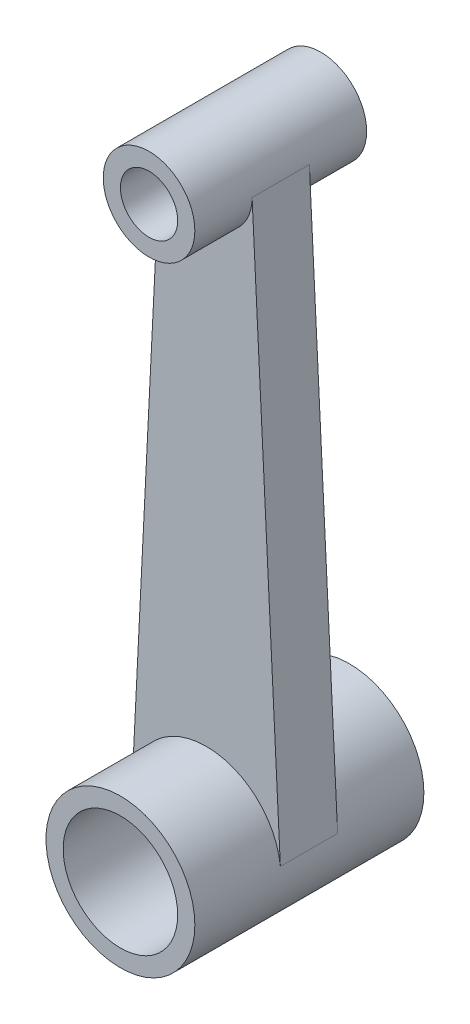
from build123d import *

# Parameters (mm, degrees)
BOSS_EXTRUDE1_DEPTH      = 19.05
BOSS_EXTRUDE1_DEPTH_BACK = 19.05
SKETCH2_R                = 10.16
SKETCH2_R_2              = 6.35
BOSS_EXTRUDE2_DEPTH      = 25.4
BOSS_EXTRUDE2_DEPTH_BACK = 25.4
SKETCH3_R                = 16.51
SKETCH3_R_2              = 12.7
BOSS_EXTRUDE3_DEPTH      = 6.35
BOSS_EXTRUDE3_DEPTH_BACK = 6.35


with BuildPart() as part:
    # Sketch2 → Boss-Extrude1 (new, two sides: drawn at the far end of the back side and taken through both)
    with BuildSketch(Plane.XY.offset(-BOSS_EXTRUDE1_DEPTH_BACK)):
        Circle(SKETCH2_R)
        Circle(SKETCH2_R_2, mode=Mode.SUBTRACT)
    extrude(amount=BOSS_EXTRUDE1_DEPTH + BOSS_EXTRUDE1_DEPTH_BACK)



with BuildPart() as body_2:
    # Sketch3 → Boss-Extrude2 (new, two sides: drawn at the far end of the back side and taken through both)
    with BuildSketch(Plane.XY.offset(-BOSS_EXTRUDE2_DEPTH_BACK)):
        with Locations((0, -127)):
            Circle(SKETCH3_R)
        with Locations((0, -127)):
            Circle(SKETCH3_R_2, mode=Mode.SUBTRACT)
    extrude(amount=BOSS_EXTRUDE2_DEPTH + BOSS_EXTRUDE2_DEPTH_BACK)


with BuildPart() as part_1:
    add(part.part)

    add(body_2.part)  # Boss-Extrude3 merges body 2
    # Sketch4 → Boss-Extrude3 (add, two sides: drawn at the far end of the back side and taken through both)
    with BuildSketch(Plane.XY.offset(-BOSS_EXTRUDE3_DEPTH_BACK)):
        with BuildLine():
            ThreePointArc((10.16, 0), (0, -10.16), (-10.16, 0))
            Line((-10.16, 0), (-16.42765586, -125.353117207))
            ThreePointArc((-16.42765586, -125.353117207), (0, -110.49), (16.42765586, -125.353117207))
            Line((16.42765586, -125.353117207), (10.16, 0))
        make_face()
    extrude(amount=BOSS_EXTRUDE3_DEPTH + BOSS_EXTRUDE3_DEPTH_BACK)


solid = part_1.part
